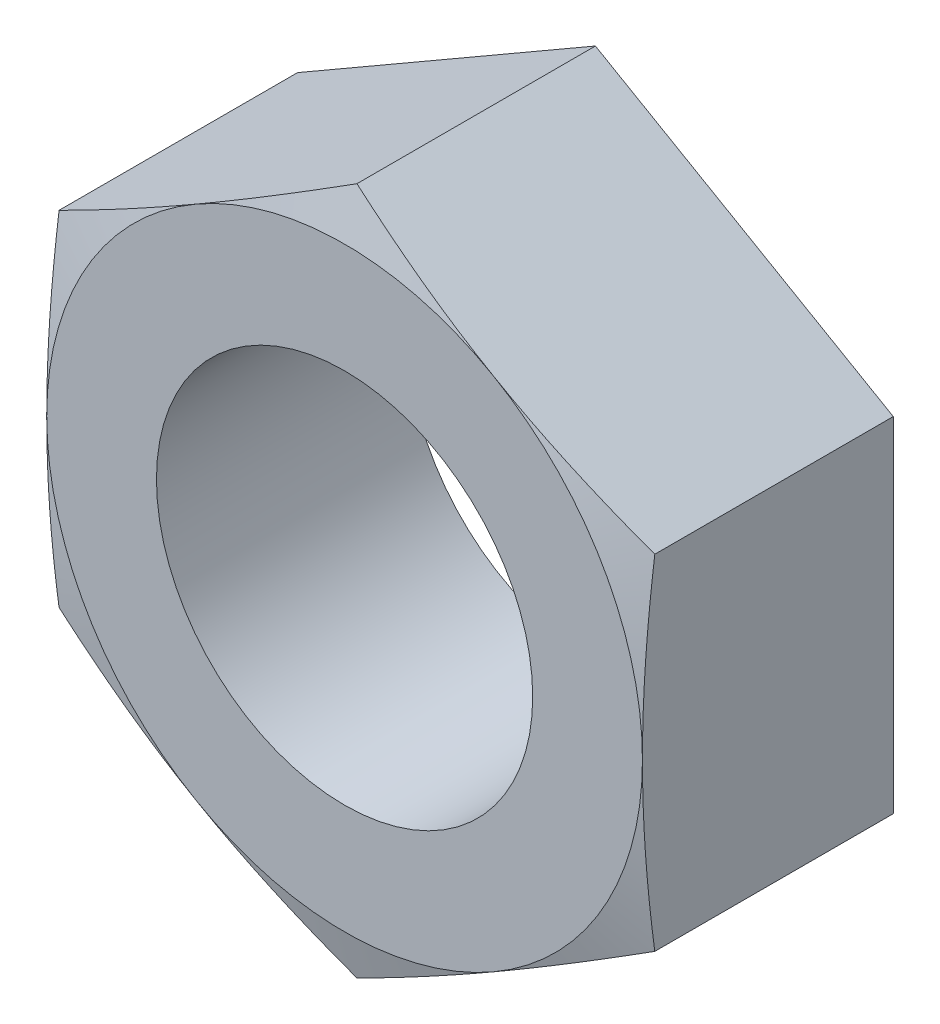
ISO-10303-21;
HEADER;
FILE_DESCRIPTION(('STEP AP214'),'2;1');
FILE_NAME('part.step','',(''),(''),'','','');
FILE_SCHEMA(('AUTOMOTIVE_DESIGN { 1 0 10303 214 1 1 1 1 }'));
ENDSEC;
DATA;
#1=APPLICATION_CONTEXT('core data for automotive mechanical design processes');
#2=APPLICATION_PROTOCOL_DEFINITION('international standard','automotive_design',2000,#1);
#3=PRODUCT_CONTEXT('',#1,'mechanical');
#4=PRODUCT('Part','Part','',(#3));
#5=PRODUCT_RELATED_PRODUCT_CATEGORY('part','',(#4));
#6=PRODUCT_DEFINITION_FORMATION('','',#4);
#7=PRODUCT_DEFINITION_CONTEXT('part definition',#1,'design');
#8=PRODUCT_DEFINITION('design','',#6,#7);
#9=PRODUCT_DEFINITION_SHAPE('','',#8);
#10=(LENGTH_UNIT() NAMED_UNIT(*) SI_UNIT(.MILLI.,.METRE.));
#11=(NAMED_UNIT(*) PLANE_ANGLE_UNIT() SI_UNIT($,.RADIAN.));
#12=(NAMED_UNIT(*) SI_UNIT($,.STERADIAN.) SOLID_ANGLE_UNIT());
#13=UNCERTAINTY_MEASURE_WITH_UNIT(LENGTH_MEASURE(1.E-05),#10,'distance_accuracy_value','');
#14=(GEOMETRIC_REPRESENTATION_CONTEXT(3) GLOBAL_UNCERTAINTY_ASSIGNED_CONTEXT((#13)) GLOBAL_UNIT_ASSIGNED_CONTEXT((#10,
#11,#12)) REPRESENTATION_CONTEXT('',''));
#15=CARTESIAN_POINT('',(0.,0.,0.));
#16=DIRECTION('',(0.,0.,1.));
#17=DIRECTION('',(1.,0.,0.));
#18=AXIS2_PLACEMENT_3D('',#15,#16,#17);
#19=CARTESIAN_POINT('',(0.,0.,8.));
#20=DIRECTION('',(0.,0.,1.));
#21=DIRECTION('',(1.,0.,0.));
#22=AXIS2_PLACEMENT_3D('',#19,#20,#21);
#23=PLANE('',#22);
#24=CARTESIAN_POINT('',(0.,0.,8.));
#25=DIRECTION('',(0.,0.,1.));
#26=DIRECTION('',(1.,0.,0.));
#27=AXIS2_PLACEMENT_3D('',#24,#25,#26);
#28=CIRCLE('',#27,6.);
#29=CARTESIAN_POINT('',(6.,0.,8.));
#30=VERTEX_POINT('',#29);
#31=EDGE_CURVE('E248',#30,#30,#28,.T.);
#32=ORIENTED_EDGE('',*,*,#31,.F.);
#33=EDGE_LOOP('',(#32));
#34=FACE_BOUND('',#33,.T.);
#35=CARTESIAN_POINT('',(0.,0.,8.));
#36=DIRECTION('',(0.,0.,1.));
#37=DIRECTION('',(1.,0.,0.));
#38=AXIS2_PLACEMENT_3D('',#35,#36,#37);
#39=CIRCLE('',#38,9.5);
#40=CARTESIAN_POINT('',(4.75,-8.22724133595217,8.));
#41=VERTEX_POINT('',#40);
#42=CARTESIAN_POINT('',(9.5,0.,8.));
#43=VERTEX_POINT('',#42);
#44=EDGE_CURVE('E118',#41,#43,#39,.T.);
#45=ORIENTED_EDGE('',*,*,#44,.T.);
#46=CARTESIAN_POINT('',(4.75,8.22724133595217,8.));
#47=VERTEX_POINT('',#46);
#48=EDGE_CURVE('E102',#43,#47,#39,.T.);
#49=ORIENTED_EDGE('',*,*,#48,.T.);
#50=CARTESIAN_POINT('',(-4.75,8.22724133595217,8.));
#51=VERTEX_POINT('',#50);
#52=EDGE_CURVE('E92',#47,#51,#39,.T.);
#53=ORIENTED_EDGE('',*,*,#52,.T.);
#54=CARTESIAN_POINT('',(-9.5,0.,8.));
#55=VERTEX_POINT('',#54);
#56=EDGE_CURVE('E36',#51,#55,#39,.T.);
#57=ORIENTED_EDGE('',*,*,#56,.T.);
#58=CARTESIAN_POINT('',(-4.75,-8.22724133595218,8.));
#59=VERTEX_POINT('',#58);
#60=EDGE_CURVE('E44',#55,#59,#39,.T.);
#61=ORIENTED_EDGE('',*,*,#60,.T.);
#62=EDGE_CURVE('E122',#59,#41,#39,.T.);
#63=ORIENTED_EDGE('',*,*,#62,.T.);
#64=EDGE_LOOP('',(#45,#49,#53,#57,#61,#63));
#65=FACE_BOUND('',#64,.T.);
#66=ADVANCED_FACE('F14',(#34,#65),#23,.T.);
#67=CARTESIAN_POINT('',(9.5,5.48482755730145,8.));
#68=DIRECTION('',(-0.5,-0.866025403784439,0.));
#69=DIRECTION('',(0.866025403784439,-0.5,0.));
#70=AXIS2_PLACEMENT_3D('',#67,#68,#69);
#71=PLANE('',#70);
#72=CARTESIAN_POINT('',(9.5002,5.48471208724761,7.6061761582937));
#73=CARTESIAN_POINT('',(9.10567227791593,5.71249277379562,7.66723483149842));
#74=CARTESIAN_POINT('',(8.71042924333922,5.94068644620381,7.72266598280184));
#75=CARTESIAN_POINT('',(7.918547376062,6.39787965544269,7.82005325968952));
#76=CARTESIAN_POINT('',(7.52190804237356,6.62687948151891,7.86200391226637));
#77=CARTESIAN_POINT('',(6.72963834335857,7.084296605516,7.92998119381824));
#78=CARTESIAN_POINT('',(6.33401333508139,7.31271081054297,7.95608888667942));
#79=CARTESIAN_POINT('',(5.54225880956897,7.76983049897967,7.99109662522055));
#80=CARTESIAN_POINT('',(5.14612940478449,7.99853591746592,8.));
#81=CARTESIAN_POINT('',(4.35387059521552,8.45594675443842,8.));
#82=CARTESIAN_POINT('',(3.95774119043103,8.68465217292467,7.99109662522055));
#83=CARTESIAN_POINT('',(3.16598666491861,9.14177186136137,7.95608888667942));
#84=CARTESIAN_POINT('',(2.77036165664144,9.37018606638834,7.92998119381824));
#85=CARTESIAN_POINT('',(1.97809195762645,9.82760319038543,7.86200391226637));
#86=CARTESIAN_POINT('',(1.58145262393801,10.0566030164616,7.82005325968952));
#87=CARTESIAN_POINT('',(0.789570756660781,10.5137962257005,7.72266598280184));
#88=CARTESIAN_POINT('',(0.39432772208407,10.7419898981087,7.66723483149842));
#89=CARTESIAN_POINT('',(-0.000199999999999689,10.9697705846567,7.6061761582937));
#90=B_SPLINE_CURVE_WITH_KNOTS('',3,(#72,#73,#74,#75,#76,#77,#78,#79,#80,#81,#82,#83,#84,#85,#86,
#87,#88,#89),.UNSPECIFIED.,.F.,.F.,(4,2,2,2,2,2,2,2,4),(0.,1.37897722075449,2.75851359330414,
4.13093041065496,5.50308163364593,6.87523285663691,8.24764967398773,9.62718604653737,
11.0061632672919),.UNSPECIFIED.);
#91=CARTESIAN_POINT('',(9.5,5.48482755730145,7.6062070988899));
#92=VERTEX_POINT('',#91);
#93=EDGE_CURVE('E107',#92,#47,#90,.T.);
#94=ORIENTED_EDGE('',*,*,#93,.F.);
#95=DIRECTION('',(0.,0.,-1.));
#96=VECTOR('',#95,1.);
#97=CARTESIAN_POINT('',(9.5,5.48482755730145,8.));
#98=LINE('',#97,#96);
#99=CARTESIAN_POINT('',(9.5,5.48482755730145,0.));
#100=VERTEX_POINT('',#99);
#101=EDGE_CURVE('E224',#92,#100,#98,.T.);
#102=ORIENTED_EDGE('',*,*,#101,.T.);
#103=DIRECTION('',(-0.866025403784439,0.5,0.));
#104=VECTOR('',#103,1.);
#105=CARTESIAN_POINT('',(9.5,5.48482755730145,0.));
#106=LINE('',#105,#104);
#107=CARTESIAN_POINT('',(0.,10.9696551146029,0.));
#108=VERTEX_POINT('',#107);
#109=EDGE_CURVE('E246',#100,#108,#106,.T.);
#110=ORIENTED_EDGE('',*,*,#109,.T.);
#111=DIRECTION('',(0.,0.,-1.));
#112=VECTOR('',#111,1.);
#113=CARTESIAN_POINT('',(0.,10.9696551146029,8.));
#114=LINE('',#113,#112);
#115=CARTESIAN_POINT('',(0.,10.9696551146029,7.6062070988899));
#116=VERTEX_POINT('',#115);
#117=EDGE_CURVE('E115',#116,#108,#114,.T.);
#118=ORIENTED_EDGE('',*,*,#117,.F.);
#119=EDGE_CURVE('E96',#47,#116,#90,.T.);
#120=ORIENTED_EDGE('',*,*,#119,.F.);
#121=EDGE_LOOP('',(#94,#102,#110,#118,#120));
#122=FACE_BOUND('',#121,.T.);
#123=ADVANCED_FACE('F16',(#122),#71,.F.);
#124=CARTESIAN_POINT('',(0.,10.9696551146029,8.));
#125=DIRECTION('',(0.5,-0.866025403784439,0.));
#126=DIRECTION('',(0.866025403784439,0.5,0.));
#127=AXIS2_PLACEMENT_3D('',#124,#125,#126);
#128=PLANE('',#127);
#129=CARTESIAN_POINT('',(0.000200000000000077,10.9697705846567,7.6061761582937));
#130=CARTESIAN_POINT('',(-0.394327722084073,10.7419898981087,7.66723483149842));
#131=CARTESIAN_POINT('',(-0.789570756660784,10.5137962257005,7.72266598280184));
#132=CARTESIAN_POINT('',(-1.58145262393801,10.0566030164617,7.82005325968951));
#133=CARTESIAN_POINT('',(-1.97809195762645,9.82760319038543,7.86200391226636));
#134=CARTESIAN_POINT('',(-2.77036165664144,9.37018606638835,7.92998119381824));
#135=CARTESIAN_POINT('',(-3.16598666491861,9.14177186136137,7.95608888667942));
#136=CARTESIAN_POINT('',(-3.95774119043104,8.68465217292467,7.99109662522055));
#137=CARTESIAN_POINT('',(-4.35387059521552,8.45594675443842,8.));
#138=CARTESIAN_POINT('',(-5.14612940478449,7.99853591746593,8.));
#139=CARTESIAN_POINT('',(-5.54225880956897,7.76983049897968,7.99109662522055));
#140=CARTESIAN_POINT('',(-6.3340133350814,7.31271081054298,7.95608888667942));
#141=CARTESIAN_POINT('',(-6.72963834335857,7.084296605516,7.92998119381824));
#142=CARTESIAN_POINT('',(-7.52190804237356,6.62687948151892,7.86200391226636));
#143=CARTESIAN_POINT('',(-7.918547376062,6.3978796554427,7.82005325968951));
#144=CARTESIAN_POINT('',(-8.71042924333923,5.94068644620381,7.72266598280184));
#145=CARTESIAN_POINT('',(-9.10567227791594,5.71249277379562,7.66723483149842));
#146=CARTESIAN_POINT('',(-9.5002,5.48471208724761,7.6061761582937));
#147=B_SPLINE_CURVE_WITH_KNOTS('',3,(#129,#130,#131,#132,#133,#134,#135,#136,#137,#138,#139,
#140,#141,#142,#143,#144,#145,#146),.UNSPECIFIED.,.F.,.F.,(4,2,2,2,2,2,2,2,4),(0.,
1.37897722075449,2.75851359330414,4.13093041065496,5.50308163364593,6.87523285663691,
8.24764967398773,9.62718604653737,11.0061632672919),.UNSPECIFIED.);
#148=EDGE_CURVE('E98',#116,#51,#147,.T.);
#149=ORIENTED_EDGE('',*,*,#148,.F.);
#150=ORIENTED_EDGE('',*,*,#117,.T.);
#151=DIRECTION('',(-0.866025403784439,-0.5,0.));
#152=VECTOR('',#151,1.);
#153=CARTESIAN_POINT('',(0.,10.9696551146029,0.));
#154=LINE('',#153,#152);
#155=CARTESIAN_POINT('',(-9.5,5.48482755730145,0.));
#156=VERTEX_POINT('',#155);
#157=EDGE_CURVE('E244',#108,#156,#154,.T.);
#158=ORIENTED_EDGE('',*,*,#157,.T.);
#159=DIRECTION('',(0.,0.,-1.));
#160=VECTOR('',#159,1.);
#161=CARTESIAN_POINT('',(-9.5,5.48482755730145,8.));
#162=LINE('',#161,#160);
#163=CARTESIAN_POINT('',(-9.5,5.48482755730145,7.6062070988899));
#164=VERTEX_POINT('',#163);
#165=EDGE_CURVE('E225',#164,#156,#162,.T.);
#166=ORIENTED_EDGE('',*,*,#165,.F.);
#167=EDGE_CURVE('E171',#51,#164,#147,.T.);
#168=ORIENTED_EDGE('',*,*,#167,.F.);
#169=EDGE_LOOP('',(#149,#150,#158,#166,#168));
#170=FACE_BOUND('',#169,.T.);
#171=ADVANCED_FACE('F182',(#170),#128,.F.);
#172=CARTESIAN_POINT('',(-9.5,5.48482755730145,8.));
#173=DIRECTION('',(1.,0.,0.));
#174=DIRECTION('',(0.,1.,0.));
#175=AXIS2_PLACEMENT_3D('',#172,#173,#174);
#176=PLANE('',#175);
#177=CARTESIAN_POINT('',(-9.5,-14.5679919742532,5.88538559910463));
#178=CARTESIAN_POINT('',(-9.50000000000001,-14.1363278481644,5.98224381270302));
#179=CARTESIAN_POINT('',(-9.50000000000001,-13.7043953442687,6.07792720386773));
#180=CARTESIAN_POINT('',(-9.50000000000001,-12.839861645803,6.26631009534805));
#181=CARTESIAN_POINT('',(-9.50000000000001,-12.4072604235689,6.35900946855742));
#182=CARTESIAN_POINT('',(-9.50000000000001,-11.54087826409,6.54086900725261));
#183=CARTESIAN_POINT('',(-9.50000000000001,-11.1070965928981,6.63002568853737));
#184=CARTESIAN_POINT('',(-9.50000000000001,-10.238634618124,6.80384687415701));
#185=CARTESIAN_POINT('',(-9.50000000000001,-9.80395432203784,6.88851141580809));
#186=CARTESIAN_POINT('',(-9.50000000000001,-8.93701020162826,7.05162370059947));
#187=CARTESIAN_POINT('',(-9.50000000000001,-8.50475472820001,7.13011561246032));
#188=CARTESIAN_POINT('',(-9.50000000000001,-7.63905699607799,7.28031287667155));
#189=CARTESIAN_POINT('',(-9.50000000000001,-7.20561473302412,7.35201820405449));
#190=CARTESIAN_POINT('',(-9.50000000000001,-6.33746858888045,7.48703708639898));
#191=CARTESIAN_POINT('',(-9.50000000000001,-5.90276487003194,7.55035167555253));
#192=CARTESIAN_POINT('',(-9.50000000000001,-5.03197226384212,7.66673505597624));
#193=CARTESIAN_POINT('',(-9.5,-4.59588337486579,7.71980383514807));
#194=CARTESIAN_POINT('',(-9.5,-3.71737492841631,7.81420587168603));
#195=CARTESIAN_POINT('',(-9.5,-3.27493998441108,7.85539805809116));
#196=CARTESIAN_POINT('',(-9.50000000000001,-2.38894520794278,7.92321293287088));
#197=CARTESIAN_POINT('',(-9.50000000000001,-1.94538540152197,7.94983595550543));
#198=CARTESIAN_POINT('',(-9.50000000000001,-1.05778635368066,7.9869604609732));
#199=CARTESIAN_POINT('',(-9.5,-0.613747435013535,7.9974695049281));
#200=CARTESIAN_POINT('',(-9.5,0.274411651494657,8.0017186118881));
#201=CARTESIAN_POINT('',(-9.5,0.718531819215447,7.99545869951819));
#202=CARTESIAN_POINT('',(-9.5,1.607857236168,7.96652108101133));
#203=CARTESIAN_POINT('',(-9.5,2.05306048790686,7.94378322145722));
#204=CARTESIAN_POINT('',(-9.5,2.94242778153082,7.8831926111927));
#205=CARTESIAN_POINT('',(-9.5,3.38659179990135,7.84533952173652));
#206=CARTESIAN_POINT('',(-9.5,4.2738759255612,7.7564450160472));
#207=CARTESIAN_POINT('',(-9.5,4.71699514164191,7.7053948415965));
#208=CARTESIAN_POINT('',(-9.5,5.60180511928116,7.59224837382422));
#209=CARTESIAN_POINT('',(-9.5,6.04349587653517,7.53015204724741));
#210=CARTESIAN_POINT('',(-9.5,6.9025982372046,7.40037581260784));
#211=CARTESIAN_POINT('',(-9.5,7.32007962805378,7.3331532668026));
#212=CARTESIAN_POINT('',(-9.5,8.1539233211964,7.19206120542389));
#213=CARTESIAN_POINT('',(-9.5,8.57028559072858,7.11819149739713));
#214=CARTESIAN_POINT('',(-9.5,9.40205388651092,6.96503690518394));
#215=CARTESIAN_POINT('',(-9.5,9.81745980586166,6.8857514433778));
#216=CARTESIAN_POINT('',(-9.5,10.647399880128,6.7227787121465));
#217=CARTESIAN_POINT('',(-9.5,11.0619340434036,6.63909148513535));
#218=CARTESIAN_POINT('',(-9.5,11.8903653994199,6.46810010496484));
#219=CARTESIAN_POINT('',(-9.49999999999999,12.3042623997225,6.38079502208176));
#220=CARTESIAN_POINT('',(-9.49999999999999,13.1314221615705,6.20322601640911));
#221=CARTESIAN_POINT('',(-9.49999999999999,13.544684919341,6.11296207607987));
#222=CARTESIAN_POINT('',(-9.49999999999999,14.7836073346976,5.83854174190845));
#223=CARTESIAN_POINT('',(-9.49999999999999,15.6084601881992,5.65074448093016));
#224=CARTESIAN_POINT('',(-9.49999999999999,17.2483700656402,5.27031657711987));
#225=CARTESIAN_POINT('',(-9.49999999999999,18.0634427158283,5.07775285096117));
#226=CARTESIAN_POINT('',(-9.49999999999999,19.6924584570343,4.68784544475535));
#227=CARTESIAN_POINT('',(-9.49999999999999,20.5064015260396,4.4905016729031));
#228=CARTESIAN_POINT('',(-9.49999999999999,22.1323785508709,4.09254079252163));
#229=CARTESIAN_POINT('',(-9.49999999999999,22.9444136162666,3.89192820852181));
#230=CARTESIAN_POINT('',(-9.49999999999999,24.1619536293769,3.58901012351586));
#231=CARTESIAN_POINT('',(-9.49999999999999,24.5677081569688,3.48770592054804));
#232=CARTESIAN_POINT('',(-9.49999999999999,25.3790690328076,3.28450759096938));
#233=CARTESIAN_POINT('',(-9.49999999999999,25.7846753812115,3.1826134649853));
#234=CARTESIAN_POINT('',(-9.5,26.1902171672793,3.08046304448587));
#235=B_SPLINE_CURVE_WITH_KNOTS('',3,(#177,#178,#179,#180,#181,#182,#183,#184,#185,#186,#187,
#188,#189,#190,#191,#192,#193,#194,#195,#196,#197,#198,#199,#200,#201,#202,#203,#204,#205,#206,
#207,#208,#209,#210,#211,#212,#213,#214,#215,#216,#217,#218,#219,#220,#221,#222,#223,#224,#225,
#226,#227,#228,#229,#230,#231,#232,#233,#234),.UNSPECIFIED.,.F.,.F.,(4,2,2,2,2,2,2,2,2,2,2,2,2,
2,2,2,2,2,2,2,2,2,2,2,2,2,2,2,4),(0.,1.3271974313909,2.65445132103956,3.98297977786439,
5.31149719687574,6.62942665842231,7.94736096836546,9.265132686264,10.5829059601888,
11.9157414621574,13.2485463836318,14.5807257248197,15.9129031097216,17.2499683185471,
18.5870634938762,19.9250483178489,21.2630371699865,22.5315498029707,23.8000991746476,
25.0687840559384,26.3374567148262,27.606457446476,28.8754657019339,31.4133012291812,
33.9258165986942,36.438380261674,38.9477203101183,40.2023487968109,41.4569759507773),.UNSPECIFIED.);
#236=EDGE_CURVE('E176',#164,#55,#235,.F.);
#237=ORIENTED_EDGE('',*,*,#236,.F.);
#238=ORIENTED_EDGE('',*,*,#165,.T.);
#239=DIRECTION('',(0.,-1.,0.));
#240=VECTOR('',#239,1.);
#241=CARTESIAN_POINT('',(-9.5,5.48482755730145,0.));
#242=LINE('',#241,#240);
#243=CARTESIAN_POINT('',(-9.5,-5.48482755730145,0.));
#244=VERTEX_POINT('',#243);
#245=EDGE_CURVE('E241',#156,#244,#242,.T.);
#246=ORIENTED_EDGE('',*,*,#245,.T.);
#247=DIRECTION('',(0.,0.,-1.));
#248=VECTOR('',#247,1.);
#249=CARTESIAN_POINT('',(-9.5,-5.48482755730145,8.));
#250=LINE('',#249,#248);
#251=CARTESIAN_POINT('',(-9.5,-5.48482755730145,7.60620709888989));
#252=VERTEX_POINT('',#251);
#253=EDGE_CURVE('E228',#252,#244,#250,.T.);
#254=ORIENTED_EDGE('',*,*,#253,.F.);
#255=EDGE_CURVE('E134',#55,#252,#235,.F.);
#256=ORIENTED_EDGE('',*,*,#255,.F.);
#257=EDGE_LOOP('',(#237,#238,#246,#254,#256));
#258=FACE_BOUND('',#257,.T.);
#259=ADVANCED_FACE('F185',(#258),#176,.F.);
#260=CARTESIAN_POINT('',(-9.5,-5.48482755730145,8.));
#261=DIRECTION('',(0.5,0.866025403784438,0.));
#262=DIRECTION('',(-0.866025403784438,0.5,0.));
#263=AXIS2_PLACEMENT_3D('',#260,#261,#262);
#264=PLANE('',#263);
#265=CARTESIAN_POINT('',(-9.5002,-5.48471208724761,7.60617615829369));
#266=CARTESIAN_POINT('',(-9.10567227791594,-5.71249277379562,7.66723483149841));
#267=CARTESIAN_POINT('',(-8.71042924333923,-5.9406864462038,7.72266598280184));
#268=CARTESIAN_POINT('',(-7.918547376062,-6.39787965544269,7.82005325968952));
#269=CARTESIAN_POINT('',(-7.52190804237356,-6.62687948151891,7.86200391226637));
#270=CARTESIAN_POINT('',(-6.72963834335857,-7.084296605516,7.92998119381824));
#271=CARTESIAN_POINT('',(-6.3340133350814,-7.31271081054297,7.95608888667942));
#272=CARTESIAN_POINT('',(-5.54225880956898,-7.76983049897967,7.99109662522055));
#273=CARTESIAN_POINT('',(-5.14612940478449,-7.99853591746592,8.));
#274=CARTESIAN_POINT('',(-4.35387059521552,-8.45594675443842,8.));
#275=CARTESIAN_POINT('',(-3.95774119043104,-8.68465217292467,7.99109662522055));
#276=CARTESIAN_POINT('',(-3.16598666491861,-9.14177186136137,7.95608888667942));
#277=CARTESIAN_POINT('',(-2.77036165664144,-9.37018606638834,7.92998119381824));
#278=CARTESIAN_POINT('',(-1.97809195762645,-9.82760319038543,7.86200391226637));
#279=CARTESIAN_POINT('',(-1.58145262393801,-10.0566030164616,7.82005325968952));
#280=CARTESIAN_POINT('',(-0.789570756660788,-10.5137962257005,7.72266598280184));
#281=CARTESIAN_POINT('',(-0.394327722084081,-10.7419898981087,7.66723483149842));
#282=CARTESIAN_POINT('',(0.000199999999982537,-10.9697705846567,7.6061761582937));
#283=B_SPLINE_CURVE_WITH_KNOTS('',3,(#265,#266,#267,#268,#269,#270,#271,#272,#273,#274,#275,
#276,#277,#278,#279,#280,#281,#282),.UNSPECIFIED.,.F.,.F.,(4,2,2,2,2,2,2,2,4),(0.,
1.37897722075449,2.75851359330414,4.13093041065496,5.50308163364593,6.87523285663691,
8.24764967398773,9.62718604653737,11.0061632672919),.UNSPECIFIED.);
#284=EDGE_CURVE('E131',#252,#59,#283,.T.);
#285=ORIENTED_EDGE('',*,*,#284,.F.);
#286=ORIENTED_EDGE('',*,*,#253,.T.);
#287=DIRECTION('',(0.866025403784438,-0.5,0.));
#288=VECTOR('',#287,1.);
#289=CARTESIAN_POINT('',(-9.5,-5.48482755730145,0.));
#290=LINE('',#289,#288);
#291=CARTESIAN_POINT('',(0.,-10.9696551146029,0.));
#292=VERTEX_POINT('',#291);
#293=EDGE_CURVE('E239',#244,#292,#290,.T.);
#294=ORIENTED_EDGE('',*,*,#293,.T.);
#295=DIRECTION('',(0.,0.,-1.));
#296=VECTOR('',#295,1.);
#297=CARTESIAN_POINT('',(0.,-10.9696551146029,8.));
#298=LINE('',#297,#296);
#299=CARTESIAN_POINT('',(0.,-10.9696551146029,7.6062070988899));
#300=VERTEX_POINT('',#299);
#301=EDGE_CURVE('E141',#300,#292,#298,.T.);
#302=ORIENTED_EDGE('',*,*,#301,.F.);
#303=EDGE_CURVE('E127',#59,#300,#283,.T.);
#304=ORIENTED_EDGE('',*,*,#303,.F.);
#305=EDGE_LOOP('',(#285,#286,#294,#302,#304));
#306=FACE_BOUND('',#305,.T.);
#307=ADVANCED_FACE('F139',(#306),#264,.F.);
#308=CARTESIAN_POINT('',(0.,-10.9696551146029,8.));
#309=DIRECTION('',(-0.5,0.866025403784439,0.));
#310=DIRECTION('',(-0.866025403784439,-0.5,0.));
#311=AXIS2_PLACEMENT_3D('',#308,#309,#310);
#312=PLANE('',#311);
#313=CARTESIAN_POINT('',(-0.000200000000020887,-10.9697705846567,7.6061761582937));
#314=CARTESIAN_POINT('',(0.394327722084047,-10.7419898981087,7.66723483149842));
#315=CARTESIAN_POINT('',(0.789570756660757,-10.5137962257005,7.72266598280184));
#316=CARTESIAN_POINT('',(1.58145262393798,-10.0566030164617,7.82005325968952));
#317=CARTESIAN_POINT('',(1.97809195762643,-9.82760319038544,7.86200391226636));
#318=CARTESIAN_POINT('',(2.77036165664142,-9.37018606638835,7.92998119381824));
#319=CARTESIAN_POINT('',(3.16598666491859,-9.14177186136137,7.95608888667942));
#320=CARTESIAN_POINT('',(3.95774119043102,-8.68465217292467,7.99109662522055));
#321=CARTESIAN_POINT('',(4.3538705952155,-8.45594675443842,8.));
#322=CARTESIAN_POINT('',(5.14612940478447,-7.99853591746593,8.));
#323=CARTESIAN_POINT('',(5.54225880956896,-7.76983049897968,7.99109662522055));
#324=CARTESIAN_POINT('',(6.33401333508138,-7.31271081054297,7.95608888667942));
#325=CARTESIAN_POINT('',(6.72963834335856,-7.084296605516,7.92998119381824));
#326=CARTESIAN_POINT('',(7.52190804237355,-6.62687948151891,7.86200391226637));
#327=CARTESIAN_POINT('',(7.91854737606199,-6.39787965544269,7.82005325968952));
#328=CARTESIAN_POINT('',(8.71042924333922,-5.9406864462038,7.72266598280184));
#329=CARTESIAN_POINT('',(9.10567227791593,-5.71249277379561,7.66723483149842));
#330=CARTESIAN_POINT('',(9.5002,-5.48471208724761,7.6061761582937));
#331=B_SPLINE_CURVE_WITH_KNOTS('',3,(#313,#314,#315,#316,#317,#318,#319,#320,#321,#322,#323,
#324,#325,#326,#327,#328,#329,#330),.UNSPECIFIED.,.F.,.F.,(4,2,2,2,2,2,2,2,4),(0.,
1.37897722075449,2.75851359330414,4.13093041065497,5.50308163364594,6.87523285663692,
8.24764967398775,9.6271860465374,11.0061632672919),.UNSPECIFIED.);
#332=EDGE_CURVE('E120',#300,#41,#331,.T.);
#333=ORIENTED_EDGE('',*,*,#332,.F.);
#334=ORIENTED_EDGE('',*,*,#301,.T.);
#335=DIRECTION('',(0.866025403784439,0.5,0.));
#336=VECTOR('',#335,1.);
#337=CARTESIAN_POINT('',(0.,-10.9696551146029,0.));
#338=LINE('',#337,#336);
#339=CARTESIAN_POINT('',(9.5,-5.48482755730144,0.));
#340=VERTEX_POINT('',#339);
#341=EDGE_CURVE('E237',#292,#340,#338,.T.);
#342=ORIENTED_EDGE('',*,*,#341,.T.);
#343=DIRECTION('',(0.,0.,-1.));
#344=VECTOR('',#343,1.);
#345=CARTESIAN_POINT('',(9.5,-5.48482755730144,8.));
#346=LINE('',#345,#344);
#347=CARTESIAN_POINT('',(9.5,-5.48482755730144,7.6062070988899));
#348=VERTEX_POINT('',#347);
#349=EDGE_CURVE('E220',#348,#340,#346,.T.);
#350=ORIENTED_EDGE('',*,*,#349,.F.);
#351=EDGE_CURVE('E119',#41,#348,#331,.T.);
#352=ORIENTED_EDGE('',*,*,#351,.F.);
#353=EDGE_LOOP('',(#333,#334,#342,#350,#352));
#354=FACE_BOUND('',#353,.T.);
#355=ADVANCED_FACE('F195',(#354),#312,.F.);
#356=CARTESIAN_POINT('',(9.5,-5.48482755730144,8.));
#357=DIRECTION('',(-1.,0.,0.));
#358=DIRECTION('',(0.,0.,1.));
#359=AXIS2_PLACEMENT_3D('',#356,#357,#358);
#360=PLANE('',#359);
#361=CARTESIAN_POINT('',(9.5,-14.5679919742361,5.88538559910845));
#362=CARTESIAN_POINT('',(9.5,-14.136327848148,5.98224381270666));
#363=CARTESIAN_POINT('',(9.5,-13.7043953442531,6.07792720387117));
#364=CARTESIAN_POINT('',(9.5,-12.8398616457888,6.26631009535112));
#365=CARTESIAN_POINT('',(9.5,-12.4072604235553,6.3590094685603));
#366=CARTESIAN_POINT('',(9.5,-11.5408782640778,6.54086900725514));
#367=CARTESIAN_POINT('',(9.5,-11.1070965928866,6.63002568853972));
#368=CARTESIAN_POINT('',(9.5,-10.2386346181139,6.803846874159));
#369=CARTESIAN_POINT('',(9.5,-9.80395432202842,6.8885114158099));
#370=CARTESIAN_POINT('',(9.5,-8.93701020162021,7.05162370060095));
#371=CARTESIAN_POINT('',(9.5,-8.50475472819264,7.13011561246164));
#372=CARTESIAN_POINT('',(9.5,-7.63905699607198,7.28031287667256));
#373=CARTESIAN_POINT('',(9.5,-7.20561473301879,7.35201820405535));
#374=CARTESIAN_POINT('',(9.5,-6.33746858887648,7.48703708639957));
#375=CARTESIAN_POINT('',(9.5,-5.90276487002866,7.55035167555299));
#376=CARTESIAN_POINT('',(9.5,-5.03197226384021,7.66673505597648));
#377=CARTESIAN_POINT('',(9.5,-4.59588337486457,7.71980383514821));
#378=CARTESIAN_POINT('',(9.5,-3.71737492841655,7.814205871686));
#379=CARTESIAN_POINT('',(9.5,-3.27493998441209,7.85539805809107));
#380=CARTESIAN_POINT('',(9.5,-2.38894520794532,7.9232129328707));
#381=CARTESIAN_POINT('',(9.5,-1.94538540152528,7.94983595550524));
#382=CARTESIAN_POINT('',(9.5,-1.05778635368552,7.98696046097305));
#383=CARTESIAN_POINT('',(9.5,-0.61374743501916,7.997469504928));
#384=CARTESIAN_POINT('',(9.5,0.274411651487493,8.00171861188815));
#385=CARTESIAN_POINT('',(9.5,0.718531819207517,7.99545869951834));
#386=CARTESIAN_POINT('',(9.5,1.60785723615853,7.96652108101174));
#387=CARTESIAN_POINT('',(9.5,2.05306048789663,7.94378322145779));
#388=CARTESIAN_POINT('',(9.5,2.94242778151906,7.88319261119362));
#389=CARTESIAN_POINT('',(9.5,3.38659179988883,7.84533952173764));
#390=CARTESIAN_POINT('',(9.5,4.27387592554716,7.75644501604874));
#391=CARTESIAN_POINT('',(9.5,4.71699514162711,7.70539484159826));
#392=CARTESIAN_POINT('',(9.5,5.60180511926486,7.59224837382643));
#393=CARTESIAN_POINT('',(9.5,6.04349587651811,7.53015204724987));
#394=CARTESIAN_POINT('',(9.5,6.90259823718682,7.40037581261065));
#395=CARTESIAN_POINT('',(9.5,7.32007962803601,7.33315326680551));
#396=CARTESIAN_POINT('',(9.5,8.15392332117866,7.19206120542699));
#397=CARTESIAN_POINT('',(9.5,8.57028559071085,7.11819149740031));
#398=CARTESIAN_POINT('',(9.5,9.40205388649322,6.96503690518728));
#399=CARTESIAN_POINT('',(9.5,9.81745980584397,6.8857514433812));
#400=CARTESIAN_POINT('',(9.5,10.6473998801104,6.72277871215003));
#401=CARTESIAN_POINT('',(9.5,11.061934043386,6.63909148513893));
#402=CARTESIAN_POINT('',(9.5,11.8903653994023,6.46810010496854));
#403=CARTESIAN_POINT('',(9.5,12.3042623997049,6.3807950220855));
#404=CARTESIAN_POINT('',(9.5,13.1314221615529,6.20322601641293));
#405=CARTESIAN_POINT('',(9.5,13.5446849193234,6.11296207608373));
#406=CARTESIAN_POINT('',(9.5,14.78360733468,5.83854174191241));
#407=CARTESIAN_POINT('',(9.5,15.6084601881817,5.65074448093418));
#408=CARTESIAN_POINT('',(9.5,17.2483700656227,5.27031657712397));
#409=CARTESIAN_POINT('',(9.5,18.0634427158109,5.07775285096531));
#410=CARTESIAN_POINT('',(9.5,19.692458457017,4.68784544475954));
#411=CARTESIAN_POINT('',(9.5,20.5064015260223,4.49050167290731));
#412=CARTESIAN_POINT('',(9.5,22.1323785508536,4.09254079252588));
#413=CARTESIAN_POINT('',(9.5,22.9444136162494,3.89192820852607));
#414=CARTESIAN_POINT('',(9.5,24.1619536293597,3.58901012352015));
#415=CARTESIAN_POINT('',(9.5,24.5677081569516,3.48770592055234));
#416=CARTESIAN_POINT('',(9.5,25.3790690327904,3.28450759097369));
#417=CARTESIAN_POINT('',(9.5,25.7846753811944,3.18261346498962));
#418=CARTESIAN_POINT('',(9.5,26.1902171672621,3.08046304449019));
#419=B_SPLINE_CURVE_WITH_KNOTS('',3,(#361,#362,#363,#364,#365,#366,#367,#368,#369,#370,#371,
#372,#373,#374,#375,#376,#377,#378,#379,#380,#381,#382,#383,#384,#385,#386,#387,#388,#389,#390,
#391,#392,#393,#394,#395,#396,#397,#398,#399,#400,#401,#402,#403,#404,#405,#406,#407,#408,#409,
#410,#411,#412,#413,#414,#415,#416,#417,#418),.UNSPECIFIED.,.F.,.F.,(4,2,2,2,2,2,2,2,2,2,2,2,2,
2,2,2,2,2,2,2,2,2,2,2,2,2,2,2,4),(0.,1.32719743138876,2.65445132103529,3.98297977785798,
5.31149719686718,6.62942665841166,7.94736096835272,9.26513268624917,10.5829059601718,
11.9157414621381,13.2485463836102,14.5807257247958,15.9129031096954,17.2499683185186,
18.5870634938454,19.9250483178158,21.263037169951,22.5315498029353,23.8000991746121,
25.0687840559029,26.3374567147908,27.6064574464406,28.8754657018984,31.4133012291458,
33.9258165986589,36.4383802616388,38.9477203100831,40.2023487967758,41.4569759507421),.UNSPECIFIED.);
#420=EDGE_CURVE('E9',#348,#43,#419,.T.);
#421=ORIENTED_EDGE('',*,*,#420,.F.);
#422=ORIENTED_EDGE('',*,*,#349,.T.);
#423=DIRECTION('',(0.,1.,0.));
#424=VECTOR('',#423,1.);
#425=CARTESIAN_POINT('',(9.5,-5.48482755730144,0.));
#426=LINE('',#425,#424);
#427=EDGE_CURVE('E235',#340,#100,#426,.T.);
#428=ORIENTED_EDGE('',*,*,#427,.T.);
#429=ORIENTED_EDGE('',*,*,#101,.F.);
#430=EDGE_CURVE('E19',#43,#92,#419,.T.);
#431=ORIENTED_EDGE('',*,*,#430,.F.);
#432=EDGE_LOOP('',(#421,#422,#428,#429,#431));
#433=FACE_BOUND('',#432,.T.);
#434=ADVANCED_FACE('F207',(#433),#360,.F.);
#435=CARTESIAN_POINT('',(0.,0.,0.));
#436=DIRECTION('',(0.,0.,1.));
#437=DIRECTION('',(1.,0.,0.));
#438=AXIS2_PLACEMENT_3D('',#435,#436,#437);
#439=PLANE('',#438);
#440=ORIENTED_EDGE('',*,*,#109,.F.);
#441=ORIENTED_EDGE('',*,*,#427,.F.);
#442=ORIENTED_EDGE('',*,*,#341,.F.);
#443=ORIENTED_EDGE('',*,*,#293,.F.);
#444=ORIENTED_EDGE('',*,*,#245,.F.);
#445=ORIENTED_EDGE('',*,*,#157,.F.);
#446=EDGE_LOOP('',(#440,#441,#442,#443,#444,#445));
#447=FACE_BOUND('',#446,.T.);
#448=CARTESIAN_POINT('',(0.,0.,0.));
#449=DIRECTION('',(0.,0.,1.));
#450=DIRECTION('',(1.,0.,0.));
#451=AXIS2_PLACEMENT_3D('',#448,#449,#450);
#452=CIRCLE('',#451,6.);
#453=CARTESIAN_POINT('',(6.,0.,0.));
#454=VERTEX_POINT('',#453);
#455=EDGE_CURVE('E111',#454,#454,#452,.T.);
#456=ORIENTED_EDGE('',*,*,#455,.T.);
#457=EDGE_LOOP('',(#456));
#458=FACE_BOUND('',#457,.T.);
#459=ADVANCED_FACE('F205',(#447,#458),#439,.F.);
#460=CARTESIAN_POINT('',(0.,0.,8.));
#461=DIRECTION('',(0.,0.,-1.));
#462=DIRECTION('',(-1.,0.,0.));
#463=AXIS2_PLACEMENT_3D('',#460,#461,#462);
#464=CYLINDRICAL_SURFACE('',#463,6.);
#465=ORIENTED_EDGE('',*,*,#31,.T.);
#466=EDGE_LOOP('',(#465));
#467=FACE_BOUND('',#466,.T.);
#468=ORIENTED_EDGE('',*,*,#455,.F.);
#469=EDGE_LOOP('',(#468));
#470=FACE_BOUND('',#469,.T.);
#471=ADVANCED_FACE('F164',(#467,#470),#464,.F.);
#472=CARTESIAN_POINT('',(0.,0.,8.));
#473=DIRECTION('',(0.,0.,-1.));
#474=DIRECTION('',(-1.,0.,0.));
#475=AXIS2_PLACEMENT_3D('',#472,#473,#474);
#476=CONICAL_SURFACE('',#475,9.5,1.30899693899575);
#477=ORIENTED_EDGE('',*,*,#93,.T.);
#478=ORIENTED_EDGE('',*,*,#48,.F.);
#479=ORIENTED_EDGE('',*,*,#430,.T.);
#480=EDGE_LOOP('',(#477,#478,#479));
#481=FACE_BOUND('',#480,.T.);
#482=ADVANCED_FACE('F108',(#481),#476,.T.);
#483=ORIENTED_EDGE('',*,*,#351,.T.);
#484=ORIENTED_EDGE('',*,*,#420,.T.);
#485=ORIENTED_EDGE('',*,*,#44,.F.);
#486=EDGE_LOOP('',(#483,#484,#485));
#487=FACE_BOUND('',#486,.T.);
#488=ADVANCED_FACE('F163',(#487),#476,.T.);
#489=ORIENTED_EDGE('',*,*,#303,.T.);
#490=ORIENTED_EDGE('',*,*,#332,.T.);
#491=ORIENTED_EDGE('',*,*,#62,.F.);
#492=EDGE_LOOP('',(#489,#490,#491));
#493=FACE_BOUND('',#492,.T.);
#494=ADVANCED_FACE('F125',(#493),#476,.T.);
#495=ORIENTED_EDGE('',*,*,#255,.T.);
#496=ORIENTED_EDGE('',*,*,#284,.T.);
#497=ORIENTED_EDGE('',*,*,#60,.F.);
#498=EDGE_LOOP('',(#495,#496,#497));
#499=FACE_BOUND('',#498,.T.);
#500=ADVANCED_FACE('F132',(#499),#476,.T.);
#501=ORIENTED_EDGE('',*,*,#167,.T.);
#502=ORIENTED_EDGE('',*,*,#236,.T.);
#503=ORIENTED_EDGE('',*,*,#56,.F.);
#504=EDGE_LOOP('',(#501,#502,#503));
#505=FACE_BOUND('',#504,.T.);
#506=ADVANCED_FACE('F290',(#505),#476,.T.);
#507=ORIENTED_EDGE('',*,*,#119,.T.);
#508=ORIENTED_EDGE('',*,*,#148,.T.);
#509=ORIENTED_EDGE('',*,*,#52,.F.);
#510=EDGE_LOOP('',(#507,#508,#509));
#511=FACE_BOUND('',#510,.T.);
#512=ADVANCED_FACE('F94',(#511),#476,.T.);
#513=CLOSED_SHELL('',(#66,#123,#171,#259,#307,#355,#434,#459,#471,#482,#488,#494,#500,#506,#512));
#514=MANIFOLD_SOLID_BREP('B1',#513);
#515=ADVANCED_BREP_SHAPE_REPRESENTATION('',(#18,#514),#14);
#516=SHAPE_DEFINITION_REPRESENTATION(#9,#515);
ENDSEC;
END-ISO-10303-21;
